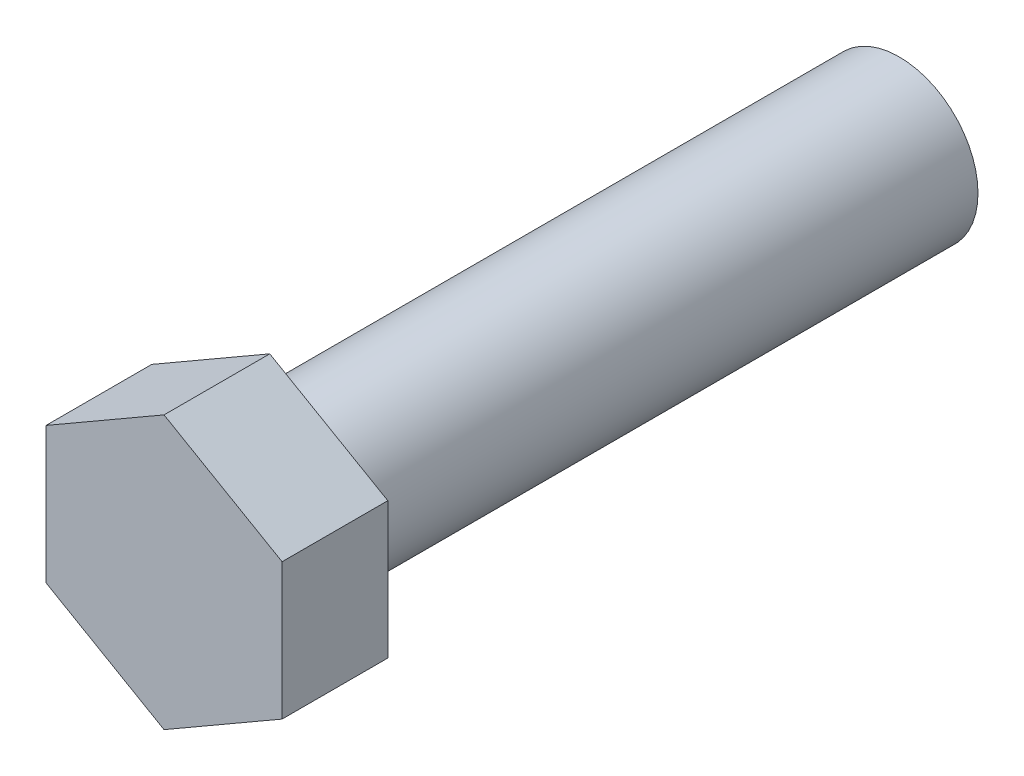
ISO-10303-21;
HEADER;
FILE_DESCRIPTION(('STEP AP214'),'2;1');
FILE_NAME('part.step','',(''),(''),'','','');
FILE_SCHEMA(('AUTOMOTIVE_DESIGN { 1 0 10303 214 1 1 1 1 }'));
ENDSEC;
DATA;
#1=APPLICATION_CONTEXT('core data for automotive mechanical design processes');
#2=APPLICATION_PROTOCOL_DEFINITION('international standard','automotive_design',2000,#1);
#3=PRODUCT_CONTEXT('',#1,'mechanical');
#4=PRODUCT('Part','Part','',(#3));
#5=PRODUCT_RELATED_PRODUCT_CATEGORY('part','',(#4));
#6=PRODUCT_DEFINITION_FORMATION('','',#4);
#7=PRODUCT_DEFINITION_CONTEXT('part definition',#1,'design');
#8=PRODUCT_DEFINITION('design','',#6,#7);
#9=PRODUCT_DEFINITION_SHAPE('','',#8);
#10=(LENGTH_UNIT() NAMED_UNIT(*) SI_UNIT(.MILLI.,.METRE.));
#11=(NAMED_UNIT(*) PLANE_ANGLE_UNIT() SI_UNIT($,.RADIAN.));
#12=(NAMED_UNIT(*) SI_UNIT($,.STERADIAN.) SOLID_ANGLE_UNIT());
#13=UNCERTAINTY_MEASURE_WITH_UNIT(LENGTH_MEASURE(1.E-05),#10,'distance_accuracy_value','');
#14=(GEOMETRIC_REPRESENTATION_CONTEXT(3) GLOBAL_UNCERTAINTY_ASSIGNED_CONTEXT((#13)) GLOBAL_UNIT_ASSIGNED_CONTEXT((#10,
#11,#12)) REPRESENTATION_CONTEXT('',''));
#15=CARTESIAN_POINT('',(0.,0.,0.));
#16=DIRECTION('',(0.,0.,1.));
#17=DIRECTION('',(1.,0.,0.));
#18=AXIS2_PLACEMENT_3D('',#15,#16,#17);
#19=CARTESIAN_POINT('',(76.2,43.9940905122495,68.2625));
#20=DIRECTION('',(-0.5,-0.866025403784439,0.));
#21=DIRECTION('',(0.866025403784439,-0.5,0.));
#22=AXIS2_PLACEMENT_3D('',#19,#20,#21);
#23=PLANE('',#22);
#24=DIRECTION('',(-0.866025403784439,0.5,0.));
#25=VECTOR('',#24,1.);
#26=CARTESIAN_POINT('',(76.2,43.9940905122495,0.));
#27=LINE('',#26,#25);
#28=CARTESIAN_POINT('',(76.2,43.9940905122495,0.));
#29=VERTEX_POINT('',#28);
#30=CARTESIAN_POINT('',(0.,87.988181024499,0.));
#31=VERTEX_POINT('',#30);
#32=EDGE_CURVE('E130',#29,#31,#27,.T.);
#33=ORIENTED_EDGE('',*,*,#32,.T.);
#34=DIRECTION('',(0.,0.,-1.));
#35=VECTOR('',#34,1.);
#36=CARTESIAN_POINT('',(0.,87.988181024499,68.2625));
#37=LINE('',#36,#35);
#38=CARTESIAN_POINT('',(0.,87.988181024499,68.2625));
#39=VERTEX_POINT('',#38);
#40=EDGE_CURVE('E11',#39,#31,#37,.T.);
#41=ORIENTED_EDGE('',*,*,#40,.F.);
#42=DIRECTION('',(-0.866025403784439,0.5,0.));
#43=VECTOR('',#42,1.);
#44=CARTESIAN_POINT('',(76.2,43.9940905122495,68.2625));
#45=LINE('',#44,#43);
#46=CARTESIAN_POINT('',(76.2,43.9940905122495,68.2625));
#47=VERTEX_POINT('',#46);
#48=EDGE_CURVE('E136',#47,#39,#45,.T.);
#49=ORIENTED_EDGE('',*,*,#48,.F.);
#50=DIRECTION('',(0.,0.,-1.));
#51=VECTOR('',#50,1.);
#52=CARTESIAN_POINT('',(76.2,43.9940905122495,68.2625));
#53=LINE('',#52,#51);
#54=EDGE_CURVE('E125',#47,#29,#53,.T.);
#55=ORIENTED_EDGE('',*,*,#54,.T.);
#56=EDGE_LOOP('',(#33,#41,#49,#55));
#57=FACE_BOUND('',#56,.T.);
#58=ADVANCED_FACE('F43',(#57),#23,.F.);
#59=CARTESIAN_POINT('',(0.,87.988181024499,68.2625));
#60=DIRECTION('',(0.5,-0.866025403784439,0.));
#61=DIRECTION('',(0.866025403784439,0.5,0.));
#62=AXIS2_PLACEMENT_3D('',#59,#60,#61);
#63=PLANE('',#62);
#64=DIRECTION('',(-0.866025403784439,-0.5,0.));
#65=VECTOR('',#64,1.);
#66=CARTESIAN_POINT('',(0.,87.988181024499,0.));
#67=LINE('',#66,#65);
#68=CARTESIAN_POINT('',(-76.2,43.9940905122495,0.));
#69=VERTEX_POINT('',#68);
#70=EDGE_CURVE('E128',#31,#69,#67,.T.);
#71=ORIENTED_EDGE('',*,*,#70,.T.);
#72=DIRECTION('',(0.,0.,-1.));
#73=VECTOR('',#72,1.);
#74=CARTESIAN_POINT('',(-76.2,43.9940905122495,68.2625));
#75=LINE('',#74,#73);
#76=CARTESIAN_POINT('',(-76.2,43.9940905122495,68.2625));
#77=VERTEX_POINT('',#76);
#78=EDGE_CURVE('E51',#77,#69,#75,.T.);
#79=ORIENTED_EDGE('',*,*,#78,.F.);
#80=DIRECTION('',(-0.866025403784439,-0.5,0.));
#81=VECTOR('',#80,1.);
#82=CARTESIAN_POINT('',(0.,87.988181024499,68.2625));
#83=LINE('',#82,#81);
#84=EDGE_CURVE('E96',#39,#77,#83,.T.);
#85=ORIENTED_EDGE('',*,*,#84,.F.);
#86=ORIENTED_EDGE('',*,*,#40,.T.);
#87=EDGE_LOOP('',(#71,#79,#85,#86));
#88=FACE_BOUND('',#87,.T.);
#89=ADVANCED_FACE('F165',(#88),#63,.F.);
#90=CARTESIAN_POINT('',(-76.2,43.9940905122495,68.2625));
#91=DIRECTION('',(1.,0.,0.));
#92=DIRECTION('',(0.,1.,0.));
#93=AXIS2_PLACEMENT_3D('',#90,#91,#92);
#94=PLANE('',#93);
#95=DIRECTION('',(0.,-1.,0.));
#96=VECTOR('',#95,1.);
#97=CARTESIAN_POINT('',(-76.2,43.9940905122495,0.));
#98=LINE('',#97,#96);
#99=CARTESIAN_POINT('',(-76.2,-43.9940905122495,0.));
#100=VERTEX_POINT('',#99);
#101=EDGE_CURVE('E134',#69,#100,#98,.T.);
#102=ORIENTED_EDGE('',*,*,#101,.T.);
#103=DIRECTION('',(0.,0.,-1.));
#104=VECTOR('',#103,1.);
#105=CARTESIAN_POINT('',(-76.2,-43.9940905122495,68.2625));
#106=LINE('',#105,#104);
#107=CARTESIAN_POINT('',(-76.2,-43.9940905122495,68.2625));
#108=VERTEX_POINT('',#107);
#109=EDGE_CURVE('E119',#108,#100,#106,.T.);
#110=ORIENTED_EDGE('',*,*,#109,.F.);
#111=DIRECTION('',(0.,-1.,0.));
#112=VECTOR('',#111,1.);
#113=CARTESIAN_POINT('',(-76.2,43.9940905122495,68.2625));
#114=LINE('',#113,#112);
#115=EDGE_CURVE('E108',#77,#108,#114,.T.);
#116=ORIENTED_EDGE('',*,*,#115,.F.);
#117=ORIENTED_EDGE('',*,*,#78,.T.);
#118=EDGE_LOOP('',(#102,#110,#116,#117));
#119=FACE_BOUND('',#118,.T.);
#120=ADVANCED_FACE('F145',(#119),#94,.F.);
#121=CARTESIAN_POINT('',(-76.2,-43.9940905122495,68.2625));
#122=DIRECTION('',(0.5,0.866025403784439,0.));
#123=DIRECTION('',(-0.866025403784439,0.5,0.));
#124=AXIS2_PLACEMENT_3D('',#121,#122,#123);
#125=PLANE('',#124);
#126=DIRECTION('',(0.866025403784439,-0.5,0.));
#127=VECTOR('',#126,1.);
#128=CARTESIAN_POINT('',(-76.2,-43.9940905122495,0.));
#129=LINE('',#128,#127);
#130=CARTESIAN_POINT('',(0.,-87.988181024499,0.));
#131=VERTEX_POINT('',#130);
#132=EDGE_CURVE('E120',#100,#131,#129,.T.);
#133=ORIENTED_EDGE('',*,*,#132,.T.);
#134=DIRECTION('',(0.,0.,-1.));
#135=VECTOR('',#134,1.);
#136=CARTESIAN_POINT('',(0.,-87.988181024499,68.2625));
#137=LINE('',#136,#135);
#138=CARTESIAN_POINT('',(0.,-87.988181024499,68.2625));
#139=VERTEX_POINT('',#138);
#140=EDGE_CURVE('E111',#139,#131,#137,.T.);
#141=ORIENTED_EDGE('',*,*,#140,.F.);
#142=DIRECTION('',(0.866025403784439,-0.5,0.));
#143=VECTOR('',#142,1.);
#144=CARTESIAN_POINT('',(-76.2,-43.9940905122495,68.2625));
#145=LINE('',#144,#143);
#146=EDGE_CURVE('E103',#108,#139,#145,.T.);
#147=ORIENTED_EDGE('',*,*,#146,.F.);
#148=ORIENTED_EDGE('',*,*,#109,.T.);
#149=EDGE_LOOP('',(#133,#141,#147,#148));
#150=FACE_BOUND('',#149,.T.);
#151=ADVANCED_FACE('F113',(#150),#125,.F.);
#152=CARTESIAN_POINT('',(0.,-87.988181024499,68.2625));
#153=DIRECTION('',(-0.5,0.866025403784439,0.));
#154=DIRECTION('',(-0.866025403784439,-0.5,0.));
#155=AXIS2_PLACEMENT_3D('',#152,#153,#154);
#156=PLANE('',#155);
#157=DIRECTION('',(0.866025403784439,0.5,0.));
#158=VECTOR('',#157,1.);
#159=CARTESIAN_POINT('',(0.,-87.988181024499,0.));
#160=LINE('',#159,#158);
#161=CARTESIAN_POINT('',(76.2,-43.9940905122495,0.));
#162=VERTEX_POINT('',#161);
#163=EDGE_CURVE('E85',#131,#162,#160,.T.);
#164=ORIENTED_EDGE('',*,*,#163,.T.);
#165=DIRECTION('',(0.,0.,-1.));
#166=VECTOR('',#165,1.);
#167=CARTESIAN_POINT('',(76.2,-43.9940905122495,68.2625));
#168=LINE('',#167,#166);
#169=CARTESIAN_POINT('',(76.2,-43.9940905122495,68.2625));
#170=VERTEX_POINT('',#169);
#171=EDGE_CURVE('E116',#170,#162,#168,.T.);
#172=ORIENTED_EDGE('',*,*,#171,.F.);
#173=DIRECTION('',(0.866025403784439,0.5,0.));
#174=VECTOR('',#173,1.);
#175=CARTESIAN_POINT('',(0.,-87.988181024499,68.2625));
#176=LINE('',#175,#174);
#177=EDGE_CURVE('E110',#139,#170,#176,.T.);
#178=ORIENTED_EDGE('',*,*,#177,.F.);
#179=ORIENTED_EDGE('',*,*,#140,.T.);
#180=EDGE_LOOP('',(#164,#172,#178,#179));
#181=FACE_BOUND('',#180,.T.);
#182=ADVANCED_FACE('F122',(#181),#156,.F.);
#183=CARTESIAN_POINT('',(76.2,-43.9940905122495,68.2625));
#184=DIRECTION('',(-1.,0.,0.));
#185=DIRECTION('',(0.,0.,1.));
#186=AXIS2_PLACEMENT_3D('',#183,#184,#185);
#187=PLANE('',#186);
#188=DIRECTION('',(0.,1.,0.));
#189=VECTOR('',#188,1.);
#190=CARTESIAN_POINT('',(76.2,-43.9940905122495,0.));
#191=LINE('',#190,#189);
#192=EDGE_CURVE('E86',#162,#29,#191,.T.);
#193=ORIENTED_EDGE('',*,*,#192,.T.);
#194=ORIENTED_EDGE('',*,*,#54,.F.);
#195=DIRECTION('',(0.,1.,0.));
#196=VECTOR('',#195,1.);
#197=CARTESIAN_POINT('',(76.2,-43.9940905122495,68.2625));
#198=LINE('',#197,#196);
#199=EDGE_CURVE('E56',#170,#47,#198,.T.);
#200=ORIENTED_EDGE('',*,*,#199,.F.);
#201=ORIENTED_EDGE('',*,*,#171,.T.);
#202=EDGE_LOOP('',(#193,#194,#200,#201));
#203=FACE_BOUND('',#202,.T.);
#204=ADVANCED_FACE('F151',(#203),#187,.F.);
#205=CARTESIAN_POINT('',(0.,0.,68.2625));
#206=DIRECTION('',(0.,0.,1.));
#207=DIRECTION('',(1.,0.,0.));
#208=AXIS2_PLACEMENT_3D('',#205,#206,#207);
#209=PLANE('',#208);
#210=ORIENTED_EDGE('',*,*,#48,.T.);
#211=ORIENTED_EDGE('',*,*,#84,.T.);
#212=ORIENTED_EDGE('',*,*,#115,.T.);
#213=ORIENTED_EDGE('',*,*,#146,.T.);
#214=ORIENTED_EDGE('',*,*,#177,.T.);
#215=ORIENTED_EDGE('',*,*,#199,.T.);
#216=EDGE_LOOP('',(#210,#211,#212,#213,#214,#215));
#217=FACE_BOUND('',#216,.T.);
#218=ADVANCED_FACE('F104',(#217),#209,.T.);
#219=CARTESIAN_POINT('',(0.,0.,0.));
#220=DIRECTION('',(0.,0.,1.));
#221=DIRECTION('',(1.,0.,0.));
#222=AXIS2_PLACEMENT_3D('',#219,#220,#221);
#223=PLANE('',#222);
#224=CARTESIAN_POINT('',(0.,0.,0.));
#225=DIRECTION('',(0.,0.,1.));
#226=DIRECTION('',(1.,0.,0.));
#227=AXIS2_PLACEMENT_3D('',#224,#225,#226);
#228=CIRCLE('',#227,50.8);
#229=CARTESIAN_POINT('',(50.8,0.,0.));
#230=VERTEX_POINT('',#229);
#231=EDGE_CURVE('E223',#230,#230,#228,.T.);
#232=ORIENTED_EDGE('',*,*,#231,.T.);
#233=EDGE_LOOP('',(#232));
#234=FACE_BOUND('',#233,.T.);
#235=ORIENTED_EDGE('',*,*,#32,.F.);
#236=ORIENTED_EDGE('',*,*,#192,.F.);
#237=ORIENTED_EDGE('',*,*,#163,.F.);
#238=ORIENTED_EDGE('',*,*,#132,.F.);
#239=ORIENTED_EDGE('',*,*,#101,.F.);
#240=ORIENTED_EDGE('',*,*,#70,.F.);
#241=EDGE_LOOP('',(#235,#236,#237,#238,#239,#240));
#242=FACE_BOUND('',#241,.T.);
#243=ADVANCED_FACE('F150',(#234,#242),#223,.F.);
#244=CARTESIAN_POINT('',(0.,0.,-406.4));
#245=DIRECTION('',(0.,0.,1.));
#246=DIRECTION('',(1.,0.,0.));
#247=AXIS2_PLACEMENT_3D('',#244,#245,#246);
#248=CYLINDRICAL_SURFACE('',#247,50.8);
#249=CARTESIAN_POINT('',(0.,0.,-406.4));
#250=DIRECTION('',(0.,0.,1.));
#251=DIRECTION('',(1.,0.,0.));
#252=AXIS2_PLACEMENT_3D('',#249,#250,#251);
#253=CIRCLE('',#252,50.8);
#254=CARTESIAN_POINT('',(50.8,0.,-406.4));
#255=VERTEX_POINT('',#254);
#256=EDGE_CURVE('E132',#255,#255,#253,.T.);
#257=ORIENTED_EDGE('',*,*,#256,.T.);
#258=EDGE_LOOP('',(#257));
#259=FACE_BOUND('',#258,.T.);
#260=ORIENTED_EDGE('',*,*,#231,.F.);
#261=EDGE_LOOP('',(#260));
#262=FACE_BOUND('',#261,.T.);
#263=ADVANCED_FACE('F203',(#259,#262),#248,.T.);
#264=CARTESIAN_POINT('',(0.,0.,-406.4));
#265=DIRECTION('',(0.,0.,1.));
#266=DIRECTION('',(1.,0.,0.));
#267=AXIS2_PLACEMENT_3D('',#264,#265,#266);
#268=PLANE('',#267);
#269=ORIENTED_EDGE('',*,*,#256,.F.);
#270=EDGE_LOOP('',(#269));
#271=FACE_BOUND('',#270,.T.);
#272=ADVANCED_FACE('F209',(#271),#268,.F.);
#273=CLOSED_SHELL('',(#58,#89,#120,#151,#182,#204,#218,#243,#263,#272));
#274=MANIFOLD_SOLID_BREP('B2',#273);
#275=ADVANCED_BREP_SHAPE_REPRESENTATION('',(#18,#274),#14);
#276=SHAPE_DEFINITION_REPRESENTATION(#9,#275);
ENDSEC;
END-ISO-10303-21;
